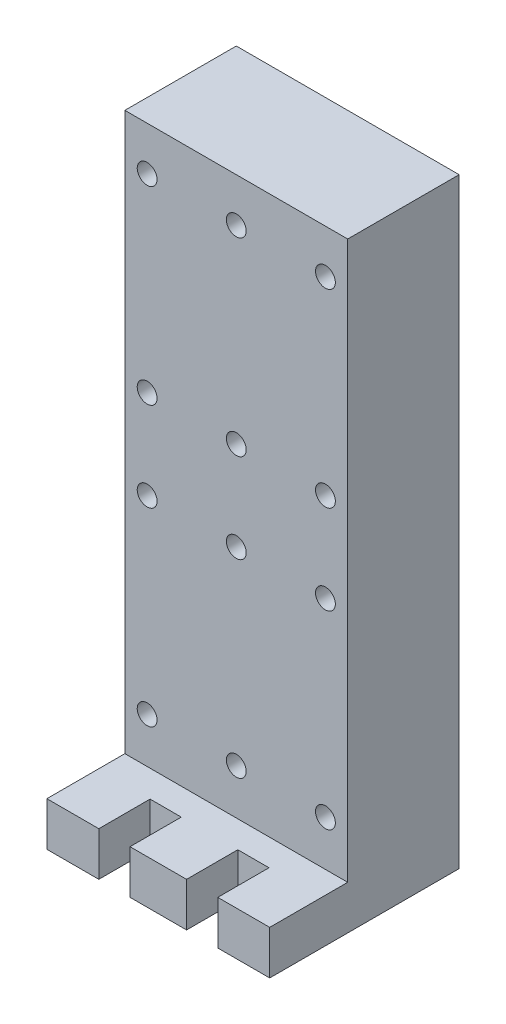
from build123d import *

# Parameters (mm, degrees)
SKETCH1_W                   = 25.4
SKETCH1_H                   = 21.59
BOSS_EXTRUDE2_DEPTH         = 5
SKETCH3_W                   = 25.4
SKETCH3_H                   = 12.7
BOSS_EXTRUDE3_DEPTH         = 63.5
F_43_0_089_DIAMETER_HOLE2_D = 2.2606
F_43_0_089_DIAMETER_HOLE3_D = 2.2606
SKETCH17_W                  = 3.556
SKETCH17_H                  = 5.842
CUT_EXTRUDE1_DEPTH          = 72.71846415


with BuildPart() as part:
    # Sketch1 → Boss-Extrude2 (new body)
    with BuildSketch(Plane(origin=(0, 0, 0), x_dir=(1, 0, 0), z_dir=(0, 1, 0))):
        with Locations((12.7, 10.795)):
            Rectangle(SKETCH1_W, SKETCH1_H)
    extrude(amount=BOSS_EXTRUDE2_DEPTH)

    # Sketch3 → Boss-Extrude3 (add)
    with BuildSketch(Plane(origin=(0, 5, 0), x_dir=(1, 0, 0), z_dir=(0, 1, 0))):
        with Locations((12.7, 15.24)):
            Rectangle(SKETCH3_W, SKETCH3_H)
    extrude(amount=BOSS_EXTRUDE3_DEPTH)

    # 43 _0.089_ Diameter Hole2 (through all)
    with Locations(Plane.XY.offset(-8.89)):
        with Locations((2.54, 31.75), (12.7, 31.75), (22.86, 31.75), (2.54, 10.16), (12.7, 10.16), (22.86, 10.16)):
            Hole(F_43_0_089_DIAMETER_HOLE2_D / 2)

    # 43 _0.089_ Diameter Hole3 (through all)
    with Locations(Plane.XY.offset(-8.89)):
        with Locations((2.54, 63.5), (12.7, 63.5), (22.86, 63.5), (2.54, 41.91), (12.7, 41.91), (22.86, 41.91)):
            Hole(F_43_0_089_DIAMETER_HOLE3_D / 2)

    # Sketch17 → Cut-Extrude1 (cut, through all)
    with BuildSketch(Plane(origin=(0, 5, 0), x_dir=(1, 0, 0), z_dir=(0, 1, 0))):
        with Locations((17.69999, 2.921)):
            Rectangle(SKETCH17_W, SKETCH17_H)
        with Locations((7.70001, 2.921)):
            Rectangle(SKETCH17_W, SKETCH17_H)
    extrude(amount=-CUT_EXTRUDE1_DEPTH, mode=Mode.SUBTRACT)


solid = part.part
